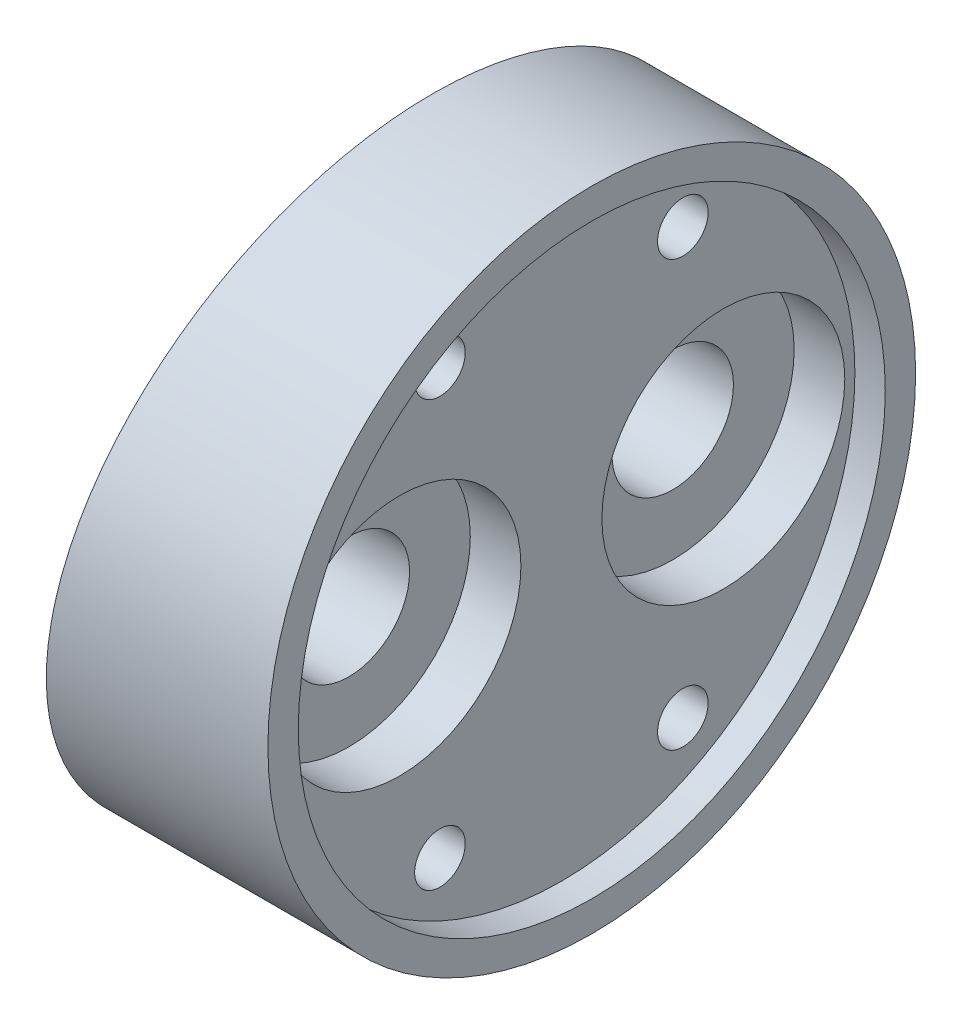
ISO-10303-21;
HEADER;
FILE_DESCRIPTION(('STEP AP214'),'2;1');
FILE_NAME('part.step','',(''),(''),'','','');
FILE_SCHEMA(('AUTOMOTIVE_DESIGN { 1 0 10303 214 1 1 1 1 }'));
ENDSEC;
DATA;
#1=APPLICATION_CONTEXT('core data for automotive mechanical design processes');
#2=APPLICATION_PROTOCOL_DEFINITION('international standard','automotive_design',2000,#1);
#3=PRODUCT_CONTEXT('',#1,'mechanical');
#4=PRODUCT('Part','Part','',(#3));
#5=PRODUCT_RELATED_PRODUCT_CATEGORY('part','',(#4));
#6=PRODUCT_DEFINITION_FORMATION('','',#4);
#7=PRODUCT_DEFINITION_CONTEXT('part definition',#1,'design');
#8=PRODUCT_DEFINITION('design','',#6,#7);
#9=PRODUCT_DEFINITION_SHAPE('','',#8);
#10=(LENGTH_UNIT() NAMED_UNIT(*) SI_UNIT(.MILLI.,.METRE.));
#11=(NAMED_UNIT(*) PLANE_ANGLE_UNIT() SI_UNIT($,.RADIAN.));
#12=(NAMED_UNIT(*) SI_UNIT($,.STERADIAN.) SOLID_ANGLE_UNIT());
#13=UNCERTAINTY_MEASURE_WITH_UNIT(LENGTH_MEASURE(1.E-05),#10,'distance_accuracy_value','');
#14=(GEOMETRIC_REPRESENTATION_CONTEXT(3) GLOBAL_UNCERTAINTY_ASSIGNED_CONTEXT((#13)) GLOBAL_UNIT_ASSIGNED_CONTEXT((#10,
#11,#12)) REPRESENTATION_CONTEXT('',''));
#15=CARTESIAN_POINT('',(0.,0.,0.));
#16=DIRECTION('',(0.,0.,1.));
#17=DIRECTION('',(1.,0.,0.));
#18=AXIS2_PLACEMENT_3D('',#15,#16,#17);
#19=CARTESIAN_POINT('',(10.7,0.,-8.));
#20=DIRECTION('',(1.,0.,0.));
#21=DIRECTION('',(0.,0.,-1.));
#22=AXIS2_PLACEMENT_3D('',#19,#20,#21);
#23=CYLINDRICAL_SURFACE('',#22,3.);
#24=CARTESIAN_POINT('',(1.9,0.,-8.));
#25=DIRECTION('',(1.,0.,0.));
#26=DIRECTION('',(0.,0.,-1.));
#27=AXIS2_PLACEMENT_3D('',#24,#25,#26);
#28=CIRCLE('',#27,3.);
#29=CARTESIAN_POINT('',(1.9,0.,-11.));
#30=VERTEX_POINT('',#29);
#31=EDGE_CURVE('E106',#30,#30,#28,.T.);
#32=ORIENTED_EDGE('',*,*,#31,.F.);
#33=EDGE_LOOP('',(#32));
#34=FACE_BOUND('',#33,.T.);
#35=CARTESIAN_POINT('',(6.7,0.,-8.));
#36=DIRECTION('',(1.,0.,0.));
#37=DIRECTION('',(0.,0.,-1.));
#38=AXIS2_PLACEMENT_3D('',#35,#36,#37);
#39=CIRCLE('',#38,3.);
#40=CARTESIAN_POINT('',(6.7,0.,-11.));
#41=VERTEX_POINT('',#40);
#42=EDGE_CURVE('E38',#41,#41,#39,.F.);
#43=ORIENTED_EDGE('',*,*,#42,.F.);
#44=EDGE_LOOP('',(#43));
#45=FACE_BOUND('',#44,.T.);
#46=ADVANCED_FACE('F34',(#34,#45),#23,.F.);
#47=CARTESIAN_POINT('',(10.7,0.,8.));
#48=DIRECTION('',(1.,0.,0.));
#49=DIRECTION('',(0.,0.,-1.));
#50=AXIS2_PLACEMENT_3D('',#47,#48,#49);
#51=CYLINDRICAL_SURFACE('',#50,3.);
#52=CARTESIAN_POINT('',(1.9,0.,8.));
#53=DIRECTION('',(1.,0.,0.));
#54=DIRECTION('',(0.,0.,-1.));
#55=AXIS2_PLACEMENT_3D('',#52,#53,#54);
#56=CIRCLE('',#55,3.);
#57=CARTESIAN_POINT('',(1.9,0.,5.));
#58=VERTEX_POINT('',#57);
#59=EDGE_CURVE('E109',#58,#58,#56,.T.);
#60=ORIENTED_EDGE('',*,*,#59,.F.);
#61=EDGE_LOOP('',(#60));
#62=FACE_BOUND('',#61,.T.);
#63=CARTESIAN_POINT('',(6.7,0.,8.));
#64=DIRECTION('',(1.,0.,0.));
#65=DIRECTION('',(0.,0.,-1.));
#66=AXIS2_PLACEMENT_3D('',#63,#64,#65);
#67=CIRCLE('',#66,3.);
#68=CARTESIAN_POINT('',(6.7,0.,5.));
#69=VERTEX_POINT('',#68);
#70=EDGE_CURVE('E74',#69,#69,#67,.F.);
#71=ORIENTED_EDGE('',*,*,#70,.F.);
#72=EDGE_LOOP('',(#71));
#73=FACE_BOUND('',#72,.T.);
#74=ADVANCED_FACE('F153',(#62,#73),#51,.F.);
#75=CARTESIAN_POINT('',(10.7,0.,0.));
#76=DIRECTION('',(-1.,0.,0.));
#77=DIRECTION('',(0.,0.,1.));
#78=AXIS2_PLACEMENT_3D('',#75,#76,#77);
#79=PLANE('',#78);
#80=CARTESIAN_POINT('',(10.7,0.,0.));
#81=DIRECTION('',(1.,0.,0.));
#82=DIRECTION('',(0.,0.,-1.));
#83=AXIS2_PLACEMENT_3D('',#80,#81,#82);
#84=CIRCLE('',#83,14.5);
#85=CARTESIAN_POINT('',(10.7,0.,-14.5));
#86=VERTEX_POINT('',#85);
#87=EDGE_CURVE('E92',#86,#86,#84,.T.);
#88=ORIENTED_EDGE('',*,*,#87,.F.);
#89=EDGE_LOOP('',(#88));
#90=FACE_BOUND('',#89,.T.);
#91=CARTESIAN_POINT('',(10.7000000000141,0.,0.));
#92=DIRECTION('',(-1.,0.,0.));
#93=DIRECTION('',(0.,0.,1.));
#94=AXIS2_PLACEMENT_3D('',#91,#92,#93);
#95=CIRCLE('',#94,16.);
#96=CARTESIAN_POINT('',(10.7000000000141,0.,16.));
#97=VERTEX_POINT('',#96);
#98=EDGE_CURVE('E43',#97,#97,#95,.T.);
#99=ORIENTED_EDGE('',*,*,#98,.F.);
#100=EDGE_LOOP('',(#99));
#101=FACE_BOUND('',#100,.T.);
#102=ADVANCED_FACE('F36',(#90,#101),#79,.F.);
#103=CARTESIAN_POINT('',(-200068.176472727,0.,0.));
#104=DIRECTION('',(-1.,0.,0.));
#105=DIRECTION('',(0.,0.,1.));
#106=AXIS2_PLACEMENT_3D('',#103,#104,#105);
#107=CYLINDRICAL_SURFACE('',#106,16.);
#108=CARTESIAN_POINT('',(0.,0.,0.));
#109=DIRECTION('',(0.984807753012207,-0.173648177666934,0.));
#110=DIRECTION('',(-0.173648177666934,-0.984807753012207,0.));
#111=AXIS2_PLACEMENT_3D('',#108,#109,#110);
#112=ELLIPSE('',#111,16.2468257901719,16.);
#113=CARTESIAN_POINT('',(-2.8212316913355,-16.,0.));
#114=VERTEX_POINT('',#113);
#115=EDGE_CURVE('E11',#114,#114,#112,.T.);
#116=ORIENTED_EDGE('',*,*,#115,.T.);
#117=EDGE_LOOP('',(#116));
#118=FACE_BOUND('',#117,.T.);
#119=ORIENTED_EDGE('',*,*,#98,.T.);
#120=EDGE_LOOP('',(#119));
#121=FACE_BOUND('',#120,.T.);
#122=ADVANCED_FACE('F177',(#118,#121),#107,.T.);
#123=CARTESIAN_POINT('',(-2.8212316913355,-16.,-50.));
#124=DIRECTION('',(0.984807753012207,-0.173648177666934,0.));
#125=DIRECTION('',(0.173648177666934,0.984807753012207,0.));
#126=AXIS2_PLACEMENT_3D('',#123,#124,#125);
#127=PLANE('',#126);
#128=CARTESIAN_POINT('',(0.,0.,-8.));
#129=DIRECTION('',(0.984807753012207,-0.173648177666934,0.));
#130=DIRECTION('',(0.173648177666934,0.984807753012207,0.));
#131=AXIS2_PLACEMENT_3D('',#128,#129,#130);
#132=ELLIPSE('',#131,0.0761569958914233,0.0749999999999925);
#133=CARTESIAN_POINT('',(0.0132245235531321,0.0749999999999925,-8.));
#134=VERTEX_POINT('',#133);
#135=EDGE_CURVE('E96',#134,#134,#132,.T.);
#136=ORIENTED_EDGE('',*,*,#135,.T.);
#137=EDGE_LOOP('',(#136));
#138=FACE_BOUND('',#137,.T.);
#139=CARTESIAN_POINT('',(0.,0.,8.));
#140=DIRECTION('',(0.984807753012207,-0.173648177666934,0.));
#141=DIRECTION('',(0.173648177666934,0.984807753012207,0.));
#142=AXIS2_PLACEMENT_3D('',#139,#140,#141);
#143=ELLIPSE('',#142,0.0761569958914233,0.0749999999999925);
#144=CARTESIAN_POINT('',(0.0132245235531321,0.0749999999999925,8.));
#145=VERTEX_POINT('',#144);
#146=EDGE_CURVE('E103',#145,#145,#143,.T.);
#147=ORIENTED_EDGE('',*,*,#146,.T.);
#148=EDGE_LOOP('',(#147));
#149=FACE_BOUND('',#148,.T.);
#150=ORIENTED_EDGE('',*,*,#115,.F.);
#151=EDGE_LOOP('',(#150));
#152=FACE_BOUND('',#151,.T.);
#153=ADVANCED_FACE('F174',(#138,#149,#152),#127,.F.);
#154=CARTESIAN_POINT('',(1.9,0.,8.));
#155=DIRECTION('',(1.,0.,0.));
#156=DIRECTION('',(0.,0.,-1.));
#157=AXIS2_PLACEMENT_3D('',#154,#155,#156);
#158=CONICAL_SURFACE('',#157,3.,1.0471975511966);
#159=CARTESIAN_POINT('',(0.211250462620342,0.,8.));
#160=DIRECTION('',(1.,0.,0.));
#161=DIRECTION('',(0.,0.,-1.));
#162=AXIS2_PLACEMENT_3D('',#159,#160,#161);
#163=CIRCLE('',#162,0.0749999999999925);
#164=CARTESIAN_POINT('',(0.211250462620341,0.,7.92500000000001));
#165=VERTEX_POINT('',#164);
#166=EDGE_CURVE('E102',#165,#165,#163,.F.);
#167=CARTESIAN_POINT('',(0.211250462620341,0.,7.92500000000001));
#168=CARTESIAN_POINT('',(0.228841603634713,0.,7.89453125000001));
#169=CARTESIAN_POINT('',(0.246432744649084,0.,7.86406250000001));
#170=CARTESIAN_POINT('',(0.281615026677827,0.,7.80312500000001));
#171=CARTESIAN_POINT('',(0.299206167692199,0.,7.77265625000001));
#172=CARTESIAN_POINT('',(0.334388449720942,0.,7.71171875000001));
#173=CARTESIAN_POINT('',(0.351979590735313,0.,7.68125000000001));
#174=CARTESIAN_POINT('',(0.387161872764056,0.,7.62031250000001));
#175=CARTESIAN_POINT('',(0.404753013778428,0.,7.58984375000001));
#176=CARTESIAN_POINT('',(0.439935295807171,0.,7.52890625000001));
#177=CARTESIAN_POINT('',(0.457526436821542,0.,7.49843750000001));
#178=CARTESIAN_POINT('',(0.492708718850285,0.,7.43750000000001));
#179=CARTESIAN_POINT('',(0.510299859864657,0.,7.40703125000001));
#180=CARTESIAN_POINT('',(0.5454821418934,0.,7.34609375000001));
#181=CARTESIAN_POINT('',(0.563073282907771,0.,7.31562500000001));
#182=CARTESIAN_POINT('',(0.598255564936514,0.,7.25468750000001));
#183=CARTESIAN_POINT('',(0.615846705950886,0.,7.22421875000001));
#184=CARTESIAN_POINT('',(0.651028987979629,0.,7.16328125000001));
#185=CARTESIAN_POINT('',(0.668620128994,0.,7.13281250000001));
#186=CARTESIAN_POINT('',(0.703802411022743,0.,7.07187500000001));
#187=CARTESIAN_POINT('',(0.721393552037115,0.,7.04140625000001));
#188=CARTESIAN_POINT('',(0.756575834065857,0.,6.98046875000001));
#189=CARTESIAN_POINT('',(0.774166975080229,0.,6.95000000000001));
#190=CARTESIAN_POINT('',(0.809349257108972,0.,6.88906250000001));
#191=CARTESIAN_POINT('',(0.826940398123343,0.,6.85859375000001));
#192=CARTESIAN_POINT('',(0.862122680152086,0.,6.79765625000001));
#193=CARTESIAN_POINT('',(0.879713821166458,0.,6.76718750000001));
#194=CARTESIAN_POINT('',(0.914896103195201,0.,6.70625000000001));
#195=CARTESIAN_POINT('',(0.932487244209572,0.,6.67578125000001));
#196=CARTESIAN_POINT('',(0.967669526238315,0.,6.61484375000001));
#197=CARTESIAN_POINT('',(0.985260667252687,0.,6.584375));
#198=CARTESIAN_POINT('',(1.02044294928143,0.,6.52343750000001));
#199=CARTESIAN_POINT('',(1.0380340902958,0.,6.49296875));
#200=CARTESIAN_POINT('',(1.07321637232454,0.,6.43203125));
#201=CARTESIAN_POINT('',(1.09080751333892,0.,6.40156250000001));
#202=CARTESIAN_POINT('',(1.12598979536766,0.,6.34062500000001));
#203=CARTESIAN_POINT('',(1.14358093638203,0.,6.31015625));
#204=CARTESIAN_POINT('',(1.17876321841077,0.,6.24921875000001));
#205=CARTESIAN_POINT('',(1.19635435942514,0.,6.21875));
#206=CARTESIAN_POINT('',(1.23153664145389,0.,6.1578125));
#207=CARTESIAN_POINT('',(1.24912778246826,0.,6.12734375));
#208=CARTESIAN_POINT('',(1.284310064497,0.,6.06640625));
#209=CARTESIAN_POINT('',(1.30190120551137,0.,6.0359375));
#210=CARTESIAN_POINT('',(1.33708348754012,0.,5.975));
#211=CARTESIAN_POINT('',(1.35467462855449,0.,5.94453125));
#212=CARTESIAN_POINT('',(1.38985691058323,0.,5.88359375));
#213=CARTESIAN_POINT('',(1.4074480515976,0.,5.853125));
#214=CARTESIAN_POINT('',(1.44263033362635,0.,5.7921875));
#215=CARTESIAN_POINT('',(1.46022147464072,0.,5.76171875));
#216=CARTESIAN_POINT('',(1.49540375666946,0.,5.70078125));
#217=CARTESIAN_POINT('',(1.51299489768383,0.,5.6703125));
#218=CARTESIAN_POINT('',(1.54817717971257,0.,5.609375));
#219=CARTESIAN_POINT('',(1.56576832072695,0.,5.57890625));
#220=CARTESIAN_POINT('',(1.60095060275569,0.,5.51796875));
#221=CARTESIAN_POINT('',(1.61854174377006,0.,5.4875));
#222=CARTESIAN_POINT('',(1.6537240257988,0.,5.4265625));
#223=CARTESIAN_POINT('',(1.67131516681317,0.,5.39609375));
#224=CARTESIAN_POINT('',(1.70649744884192,0.,5.33515625));
#225=CARTESIAN_POINT('',(1.72408858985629,0.,5.3046875));
#226=CARTESIAN_POINT('',(1.75927087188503,0.,5.24375));
#227=CARTESIAN_POINT('',(1.7768620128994,0.,5.21328125));
#228=CARTESIAN_POINT('',(1.81204429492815,0.,5.15234375));
#229=CARTESIAN_POINT('',(1.82963543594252,0.,5.121875));
#230=CARTESIAN_POINT('',(1.86481771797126,0.,5.0609375));
#231=CARTESIAN_POINT('',(1.88240885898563,0.,5.03046875));
#232=CARTESIAN_POINT('',(1.9,0.,5.));
#233=B_SPLINE_CURVE_WITH_KNOTS('',3,(#167,#168,#169,#170,#171,#172,#173,#174,#175,#176,#177,
#178,#179,#180,#181,#182,#183,#184,#185,#186,#187,#188,#189,#190,#191,#192,#193,#194,#195,#196,
#197,#198,#199,#200,#201,#202,#203,#204,#205,#206,#207,#208,#209,#210,#211,#212,#213,#214,#215,
#216,#217,#218,#219,#220,#221,#222,#223,#224,#225,#226,#227,#228,#229,#230,#231,#232),
.UNSPECIFIED.,.F.,.F.,(4,2,2,2,2,2,2,2,2,2,2,2,2,2,2,2,2,2,2,2,2,2,2,2,2,2,2,2,2,2,2,2,4),(0.,
0.105546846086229,0.211093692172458,0.316640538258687,0.422187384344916,0.527734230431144,
0.633281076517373,0.738827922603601,0.84437476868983,0.949921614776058,1.05546846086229,
1.16101530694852,1.26656215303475,1.37210899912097,1.4776558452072,1.58320269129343,
1.68874953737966,1.79429638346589,1.89984322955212,2.00539007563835,2.11093692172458,
2.2164837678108,2.32203061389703,2.42757745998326,2.53312430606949,2.63867115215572,
2.74421799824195,2.84976484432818,2.95531169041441,3.06085853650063,3.16640538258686,
3.27195222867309,3.37749907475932),.UNSPECIFIED.);
#234=EDGE_CURVE('BSEAM169',#165,#58,#233,.T.);
#235=ORIENTED_EDGE('',*,*,#166,.T.);
#236=ORIENTED_EDGE('',*,*,#59,.T.);
#237=ORIENTED_EDGE('',*,*,#234,.T.);
#238=ORIENTED_EDGE('',*,*,#234,.F.);
#239=EDGE_LOOP('',(#235,#237,#236,#238));
#240=FACE_BOUND('',#239,.T.);
#241=ADVANCED_FACE('F169',(#240),#158,.F.);
#242=CARTESIAN_POINT('',(1.9,0.,-8.));
#243=DIRECTION('',(1.,0.,0.));
#244=DIRECTION('',(0.,0.,-1.));
#245=AXIS2_PLACEMENT_3D('',#242,#243,#244);
#246=CONICAL_SURFACE('',#245,3.,1.0471975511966);
#247=CARTESIAN_POINT('',(0.211250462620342,0.,-8.));
#248=DIRECTION('',(1.,0.,0.));
#249=DIRECTION('',(0.,0.,-1.));
#250=AXIS2_PLACEMENT_3D('',#247,#248,#249);
#251=CIRCLE('',#250,0.0749999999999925);
#252=CARTESIAN_POINT('',(0.211250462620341,0.,-8.07499999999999));
#253=VERTEX_POINT('',#252);
#254=EDGE_CURVE('E99',#253,#253,#251,.F.);
#255=CARTESIAN_POINT('',(0.211250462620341,0.,-8.07499999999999));
#256=CARTESIAN_POINT('',(0.228841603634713,0.,-8.10546874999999));
#257=CARTESIAN_POINT('',(0.246432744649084,0.,-8.13593749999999));
#258=CARTESIAN_POINT('',(0.281615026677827,0.,-8.19687499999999));
#259=CARTESIAN_POINT('',(0.299206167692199,0.,-8.22734374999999));
#260=CARTESIAN_POINT('',(0.334388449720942,0.,-8.28828124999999));
#261=CARTESIAN_POINT('',(0.351979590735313,0.,-8.31874999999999));
#262=CARTESIAN_POINT('',(0.387161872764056,0.,-8.37968749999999));
#263=CARTESIAN_POINT('',(0.404753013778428,0.,-8.41015624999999));
#264=CARTESIAN_POINT('',(0.439935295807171,0.,-8.47109374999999));
#265=CARTESIAN_POINT('',(0.457526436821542,0.,-8.50156249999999));
#266=CARTESIAN_POINT('',(0.492708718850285,0.,-8.56249999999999));
#267=CARTESIAN_POINT('',(0.510299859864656,0.,-8.59296874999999));
#268=CARTESIAN_POINT('',(0.5454821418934,0.,-8.65390624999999));
#269=CARTESIAN_POINT('',(0.563073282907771,0.,-8.68437499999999));
#270=CARTESIAN_POINT('',(0.598255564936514,0.,-8.74531249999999));
#271=CARTESIAN_POINT('',(0.615846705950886,0.,-8.77578124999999));
#272=CARTESIAN_POINT('',(0.651028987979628,0.,-8.83671874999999));
#273=CARTESIAN_POINT('',(0.668620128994,0.,-8.86718749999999));
#274=CARTESIAN_POINT('',(0.703802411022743,0.,-8.92812499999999));
#275=CARTESIAN_POINT('',(0.721393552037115,0.,-8.95859374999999));
#276=CARTESIAN_POINT('',(0.756575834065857,0.,-9.01953124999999));
#277=CARTESIAN_POINT('',(0.774166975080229,0.,-9.04999999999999));
#278=CARTESIAN_POINT('',(0.809349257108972,0.,-9.11093749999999));
#279=CARTESIAN_POINT('',(0.826940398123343,0.,-9.14140624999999));
#280=CARTESIAN_POINT('',(0.862122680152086,0.,-9.20234374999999));
#281=CARTESIAN_POINT('',(0.879713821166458,0.,-9.23281249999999));
#282=CARTESIAN_POINT('',(0.914896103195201,0.,-9.29374999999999));
#283=CARTESIAN_POINT('',(0.932487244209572,0.,-9.32421874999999));
#284=CARTESIAN_POINT('',(0.967669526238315,0.,-9.38515624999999));
#285=CARTESIAN_POINT('',(0.985260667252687,0.,-9.415625));
#286=CARTESIAN_POINT('',(1.02044294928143,0.,-9.47656249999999));
#287=CARTESIAN_POINT('',(1.0380340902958,0.,-9.50703125));
#288=CARTESIAN_POINT('',(1.07321637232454,0.,-9.56796875));
#289=CARTESIAN_POINT('',(1.09080751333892,0.,-9.5984375));
#290=CARTESIAN_POINT('',(1.12598979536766,0.,-9.659375));
#291=CARTESIAN_POINT('',(1.14358093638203,0.,-9.68984375));
#292=CARTESIAN_POINT('',(1.17876321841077,0.,-9.75078125));
#293=CARTESIAN_POINT('',(1.19635435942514,0.,-9.78124999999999));
#294=CARTESIAN_POINT('',(1.23153664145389,0.,-9.84218749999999));
#295=CARTESIAN_POINT('',(1.24912778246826,0.,-9.87265625));
#296=CARTESIAN_POINT('',(1.284310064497,0.,-9.93359374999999));
#297=CARTESIAN_POINT('',(1.30190120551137,0.,-9.9640625));
#298=CARTESIAN_POINT('',(1.33708348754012,0.,-10.025));
#299=CARTESIAN_POINT('',(1.35467462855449,0.,-10.05546875));
#300=CARTESIAN_POINT('',(1.38985691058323,0.,-10.11640625));
#301=CARTESIAN_POINT('',(1.4074480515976,0.,-10.146875));
#302=CARTESIAN_POINT('',(1.44263033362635,0.,-10.2078125));
#303=CARTESIAN_POINT('',(1.46022147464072,0.,-10.23828125));
#304=CARTESIAN_POINT('',(1.49540375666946,0.,-10.29921875));
#305=CARTESIAN_POINT('',(1.51299489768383,0.,-10.3296875));
#306=CARTESIAN_POINT('',(1.54817717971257,0.,-10.390625));
#307=CARTESIAN_POINT('',(1.56576832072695,0.,-10.42109375));
#308=CARTESIAN_POINT('',(1.60095060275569,0.,-10.48203125));
#309=CARTESIAN_POINT('',(1.61854174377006,0.,-10.5125));
#310=CARTESIAN_POINT('',(1.6537240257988,0.,-10.5734375));
#311=CARTESIAN_POINT('',(1.67131516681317,0.,-10.60390625));
#312=CARTESIAN_POINT('',(1.70649744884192,0.,-10.66484375));
#313=CARTESIAN_POINT('',(1.72408858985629,0.,-10.6953125));
#314=CARTESIAN_POINT('',(1.75927087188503,0.,-10.75625));
#315=CARTESIAN_POINT('',(1.7768620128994,0.,-10.78671875));
#316=CARTESIAN_POINT('',(1.81204429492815,0.,-10.84765625));
#317=CARTESIAN_POINT('',(1.82963543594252,0.,-10.878125));
#318=CARTESIAN_POINT('',(1.86481771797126,0.,-10.9390625));
#319=CARTESIAN_POINT('',(1.88240885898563,0.,-10.96953125));
#320=CARTESIAN_POINT('',(1.9,0.,-11.));
#321=B_SPLINE_CURVE_WITH_KNOTS('',3,(#255,#256,#257,#258,#259,#260,#261,#262,#263,#264,#265,
#266,#267,#268,#269,#270,#271,#272,#273,#274,#275,#276,#277,#278,#279,#280,#281,#282,#283,#284,
#285,#286,#287,#288,#289,#290,#291,#292,#293,#294,#295,#296,#297,#298,#299,#300,#301,#302,#303,
#304,#305,#306,#307,#308,#309,#310,#311,#312,#313,#314,#315,#316,#317,#318,#319,#320),
.UNSPECIFIED.,.F.,.F.,(4,2,2,2,2,2,2,2,2,2,2,2,2,2,2,2,2,2,2,2,2,2,2,2,2,2,2,2,2,2,2,2,4),(0.,
0.105546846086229,0.211093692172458,0.316640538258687,0.422187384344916,0.527734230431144,
0.633281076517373,0.738827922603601,0.844374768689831,0.949921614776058,1.05546846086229,
1.16101530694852,1.26656215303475,1.37210899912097,1.4776558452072,1.58320269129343,
1.68874953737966,1.79429638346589,1.89984322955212,2.00539007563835,2.11093692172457,
2.2164837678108,2.32203061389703,2.42757745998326,2.53312430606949,2.63867115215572,
2.74421799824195,2.84976484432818,2.95531169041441,3.06085853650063,3.16640538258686,
3.27195222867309,3.37749907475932),.UNSPECIFIED.);
#322=EDGE_CURVE('BSEAM167',#253,#30,#321,.T.);
#323=ORIENTED_EDGE('',*,*,#254,.T.);
#324=ORIENTED_EDGE('',*,*,#31,.T.);
#325=ORIENTED_EDGE('',*,*,#322,.T.);
#326=ORIENTED_EDGE('',*,*,#322,.F.);
#327=EDGE_LOOP('',(#323,#325,#324,#326));
#328=FACE_BOUND('',#327,.T.);
#329=ADVANCED_FACE('F167',(#328),#246,.F.);
#330=CARTESIAN_POINT('',(10.7,0.,8.));
#331=DIRECTION('',(1.,0.,0.));
#332=DIRECTION('',(0.,0.,-1.));
#333=AXIS2_PLACEMENT_3D('',#330,#331,#332);
#334=CYLINDRICAL_SURFACE('',#333,0.0749999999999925);
#335=ORIENTED_EDGE('',*,*,#166,.F.);
#336=EDGE_LOOP('',(#335));
#337=FACE_BOUND('',#336,.T.);
#338=ORIENTED_EDGE('',*,*,#146,.F.);
#339=EDGE_LOOP('',(#338));
#340=FACE_BOUND('',#339,.T.);
#341=ADVANCED_FACE('F165',(#337,#340),#334,.F.);
#342=CARTESIAN_POINT('',(10.7,0.,-8.));
#343=DIRECTION('',(1.,0.,0.));
#344=DIRECTION('',(0.,0.,-1.));
#345=AXIS2_PLACEMENT_3D('',#342,#343,#344);
#346=CYLINDRICAL_SURFACE('',#345,0.0749999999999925);
#347=ORIENTED_EDGE('',*,*,#135,.F.);
#348=EDGE_LOOP('',(#347));
#349=FACE_BOUND('',#348,.T.);
#350=ORIENTED_EDGE('',*,*,#254,.F.);
#351=EDGE_LOOP('',(#350));
#352=FACE_BOUND('',#351,.T.);
#353=ADVANCED_FACE('F206',(#349,#352),#346,.F.);
#354=CARTESIAN_POINT('',(9.2,0.,0.));
#355=DIRECTION('',(1.,0.,0.));
#356=DIRECTION('',(0.,0.,-1.));
#357=AXIS2_PLACEMENT_3D('',#354,#355,#356);
#358=PLANE('',#357);
#359=CARTESIAN_POINT('',(9.2,0.,-8.));
#360=DIRECTION('',(1.,0.,0.));
#361=DIRECTION('',(0.,0.,-1.));
#362=AXIS2_PLACEMENT_3D('',#359,#360,#361);
#363=CIRCLE('',#362,6.);
#364=CARTESIAN_POINT('',(9.2,0.,-14.));
#365=VERTEX_POINT('',#364);
#366=EDGE_CURVE('E123',#365,#365,#363,.T.);
#367=ORIENTED_EDGE('',*,*,#366,.F.);
#368=EDGE_LOOP('',(#367));
#369=FACE_BOUND('',#368,.T.);
#370=CARTESIAN_POINT('',(9.2,0.,8.));
#371=DIRECTION('',(1.,0.,0.));
#372=DIRECTION('',(0.,0.,-1.));
#373=AXIS2_PLACEMENT_3D('',#370,#371,#372);
#374=CIRCLE('',#373,6.);
#375=CARTESIAN_POINT('',(9.2,0.,2.));
#376=VERTEX_POINT('',#375);
#377=EDGE_CURVE('E118',#376,#376,#374,.T.);
#378=ORIENTED_EDGE('',*,*,#377,.F.);
#379=EDGE_LOOP('',(#378));
#380=FACE_BOUND('',#379,.T.);
#381=CARTESIAN_POINT('',(9.2,10.5,-6.));
#382=DIRECTION('',(1.,0.,0.));
#383=DIRECTION('',(0.,0.,-1.));
#384=AXIS2_PLACEMENT_3D('',#381,#382,#383);
#385=CIRCLE('',#384,1.25);
#386=CARTESIAN_POINT('',(9.2,10.5,-7.25));
#387=VERTEX_POINT('',#386);
#388=EDGE_CURVE('E68',#387,#387,#385,.T.);
#389=ORIENTED_EDGE('',*,*,#388,.F.);
#390=EDGE_LOOP('',(#389));
#391=FACE_BOUND('',#390,.T.);
#392=CARTESIAN_POINT('',(9.2,10.5,6.));
#393=DIRECTION('',(1.,0.,0.));
#394=DIRECTION('',(0.,0.,-1.));
#395=AXIS2_PLACEMENT_3D('',#392,#393,#394);
#396=CIRCLE('',#395,1.25);
#397=CARTESIAN_POINT('',(9.2,10.5,4.75));
#398=VERTEX_POINT('',#397);
#399=EDGE_CURVE('E67',#398,#398,#396,.T.);
#400=ORIENTED_EDGE('',*,*,#399,.F.);
#401=EDGE_LOOP('',(#400));
#402=FACE_BOUND('',#401,.T.);
#403=CARTESIAN_POINT('',(9.2,-10.5,6.));
#404=DIRECTION('',(1.,0.,0.));
#405=DIRECTION('',(0.,0.,-1.));
#406=AXIS2_PLACEMENT_3D('',#403,#404,#405);
#407=CIRCLE('',#406,1.25);
#408=CARTESIAN_POINT('',(9.2,-10.5,4.75));
#409=VERTEX_POINT('',#408);
#410=EDGE_CURVE('E80',#409,#409,#407,.T.);
#411=ORIENTED_EDGE('',*,*,#410,.F.);
#412=EDGE_LOOP('',(#411));
#413=FACE_BOUND('',#412,.T.);
#414=CARTESIAN_POINT('',(9.2,-10.5,-6.));
#415=DIRECTION('',(1.,0.,0.));
#416=DIRECTION('',(0.,0.,-1.));
#417=AXIS2_PLACEMENT_3D('',#414,#415,#416);
#418=CIRCLE('',#417,1.25);
#419=CARTESIAN_POINT('',(9.2,-10.5,-7.25));
#420=VERTEX_POINT('',#419);
#421=EDGE_CURVE('E86',#420,#420,#418,.T.);
#422=ORIENTED_EDGE('',*,*,#421,.F.);
#423=EDGE_LOOP('',(#422));
#424=FACE_BOUND('',#423,.T.);
#425=CARTESIAN_POINT('',(9.2,0.,0.));
#426=DIRECTION('',(1.,0.,0.));
#427=DIRECTION('',(0.,0.,-1.));
#428=AXIS2_PLACEMENT_3D('',#425,#426,#427);
#429=CIRCLE('',#428,14.5);
#430=CARTESIAN_POINT('',(9.2,0.,-14.5));
#431=VERTEX_POINT('',#430);
#432=EDGE_CURVE('E93',#431,#431,#429,.T.);
#433=ORIENTED_EDGE('',*,*,#432,.T.);
#434=EDGE_LOOP('',(#433));
#435=FACE_BOUND('',#434,.T.);
#436=ADVANCED_FACE('F197',(#369,#380,#391,#402,#413,#424,#435),#358,.T.);
#437=CARTESIAN_POINT('',(9.2,0.,0.));
#438=DIRECTION('',(1.,0.,0.));
#439=DIRECTION('',(0.,0.,-1.));
#440=AXIS2_PLACEMENT_3D('',#437,#438,#439);
#441=CYLINDRICAL_SURFACE('',#440,14.5);
#442=ORIENTED_EDGE('',*,*,#432,.F.);
#443=EDGE_LOOP('',(#442));
#444=FACE_BOUND('',#443,.T.);
#445=ORIENTED_EDGE('',*,*,#87,.T.);
#446=EDGE_LOOP('',(#445));
#447=FACE_BOUND('',#446,.T.);
#448=ADVANCED_FACE('F194',(#444,#447),#441,.F.);
#449=CARTESIAN_POINT('',(3.20000000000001,-10.5,-6.));
#450=DIRECTION('',(1.,0.,0.));
#451=DIRECTION('',(0.,0.,-1.));
#452=AXIS2_PLACEMENT_3D('',#449,#450,#451);
#453=CONICAL_SURFACE('',#452,1.25,1.02974425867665);
#454=CARTESIAN_POINT('',(2.44892422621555,-10.5,-6.));
#455=VERTEX_POINT('',#454);
#456=VERTEX_LOOP('',#455);
#457=FACE_BOUND('',#456,.T.);
#458=CARTESIAN_POINT('',(3.20000000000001,-10.5,-6.));
#459=DIRECTION('',(1.,0.,0.));
#460=DIRECTION('',(0.,0.,-1.));
#461=AXIS2_PLACEMENT_3D('',#458,#459,#460);
#462=CIRCLE('',#461,1.25);
#463=CARTESIAN_POINT('',(3.20000000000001,-10.5,-7.25));
#464=VERTEX_POINT('',#463);
#465=EDGE_CURVE('E89',#464,#464,#462,.T.);
#466=ORIENTED_EDGE('',*,*,#465,.T.);
#467=EDGE_LOOP('',(#466));
#468=FACE_BOUND('',#467,.T.);
#469=ADVANCED_FACE('F196',(#457,#468),#453,.F.);
#470=CARTESIAN_POINT('',(9.2,-10.5,-6.));
#471=DIRECTION('',(1.,0.,0.));
#472=DIRECTION('',(0.,0.,-1.));
#473=AXIS2_PLACEMENT_3D('',#470,#471,#472);
#474=CYLINDRICAL_SURFACE('',#473,1.25);
#475=ORIENTED_EDGE('',*,*,#465,.F.);
#476=EDGE_LOOP('',(#475));
#477=FACE_BOUND('',#476,.T.);
#478=ORIENTED_EDGE('',*,*,#421,.T.);
#479=EDGE_LOOP('',(#478));
#480=FACE_BOUND('',#479,.T.);
#481=ADVANCED_FACE('F204',(#477,#480),#474,.F.);
#482=CARTESIAN_POINT('',(3.20000000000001,-10.5,6.));
#483=DIRECTION('',(1.,0.,0.));
#484=DIRECTION('',(0.,0.,-1.));
#485=AXIS2_PLACEMENT_3D('',#482,#483,#484);
#486=CONICAL_SURFACE('',#485,1.25,1.02974425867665);
#487=CARTESIAN_POINT('',(2.44892422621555,-10.5,6.));
#488=VERTEX_POINT('',#487);
#489=VERTEX_LOOP('',#488);
#490=FACE_BOUND('',#489,.T.);
#491=CARTESIAN_POINT('',(3.20000000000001,-10.5,6.));
#492=DIRECTION('',(1.,0.,0.));
#493=DIRECTION('',(0.,0.,-1.));
#494=AXIS2_PLACEMENT_3D('',#491,#492,#493);
#495=CIRCLE('',#494,1.25);
#496=CARTESIAN_POINT('',(3.20000000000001,-10.5,4.75));
#497=VERTEX_POINT('',#496);
#498=EDGE_CURVE('E83',#497,#497,#495,.T.);
#499=ORIENTED_EDGE('',*,*,#498,.T.);
#500=EDGE_LOOP('',(#499));
#501=FACE_BOUND('',#500,.T.);
#502=ADVANCED_FACE('F273',(#490,#501),#486,.F.);
#503=CARTESIAN_POINT('',(9.2,-10.5,6.));
#504=DIRECTION('',(1.,0.,0.));
#505=DIRECTION('',(0.,0.,-1.));
#506=AXIS2_PLACEMENT_3D('',#503,#504,#505);
#507=CYLINDRICAL_SURFACE('',#506,1.25);
#508=ORIENTED_EDGE('',*,*,#498,.F.);
#509=EDGE_LOOP('',(#508));
#510=FACE_BOUND('',#509,.T.);
#511=ORIENTED_EDGE('',*,*,#410,.T.);
#512=EDGE_LOOP('',(#511));
#513=FACE_BOUND('',#512,.T.);
#514=ADVANCED_FACE('F284',(#510,#513),#507,.F.);
#515=CARTESIAN_POINT('',(3.20000000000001,10.5,6.));
#516=DIRECTION('',(1.,0.,0.));
#517=DIRECTION('',(0.,0.,-1.));
#518=AXIS2_PLACEMENT_3D('',#515,#516,#517);
#519=CONICAL_SURFACE('',#518,1.25,1.02974425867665);
#520=CARTESIAN_POINT('',(2.44892422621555,10.5,6.));
#521=VERTEX_POINT('',#520);
#522=VERTEX_LOOP('',#521);
#523=FACE_BOUND('',#522,.T.);
#524=CARTESIAN_POINT('',(3.20000000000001,10.5,6.));
#525=DIRECTION('',(1.,0.,0.));
#526=DIRECTION('',(0.,0.,-1.));
#527=AXIS2_PLACEMENT_3D('',#524,#525,#526);
#528=CIRCLE('',#527,1.25);
#529=CARTESIAN_POINT('',(3.20000000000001,10.5,4.75));
#530=VERTEX_POINT('',#529);
#531=EDGE_CURVE('E71',#530,#530,#528,.T.);
#532=ORIENTED_EDGE('',*,*,#531,.T.);
#533=EDGE_LOOP('',(#532));
#534=FACE_BOUND('',#533,.T.);
#535=ADVANCED_FACE('F293',(#523,#534),#519,.F.);
#536=CARTESIAN_POINT('',(9.2,10.5,6.));
#537=DIRECTION('',(1.,0.,0.));
#538=DIRECTION('',(0.,0.,-1.));
#539=AXIS2_PLACEMENT_3D('',#536,#537,#538);
#540=CYLINDRICAL_SURFACE('',#539,1.25);
#541=ORIENTED_EDGE('',*,*,#531,.F.);
#542=EDGE_LOOP('',(#541));
#543=FACE_BOUND('',#542,.T.);
#544=ORIENTED_EDGE('',*,*,#399,.T.);
#545=EDGE_LOOP('',(#544));
#546=FACE_BOUND('',#545,.T.);
#547=ADVANCED_FACE('F61',(#543,#546),#540,.F.);
#548=CARTESIAN_POINT('',(3.20000000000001,10.5,-6.));
#549=DIRECTION('',(1.,0.,0.));
#550=DIRECTION('',(0.,0.,-1.));
#551=AXIS2_PLACEMENT_3D('',#548,#549,#550);
#552=CONICAL_SURFACE('',#551,1.25,1.02974425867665);
#553=CARTESIAN_POINT('',(2.44892422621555,10.5,-6.));
#554=VERTEX_POINT('',#553);
#555=VERTEX_LOOP('',#554);
#556=FACE_BOUND('',#555,.T.);
#557=CARTESIAN_POINT('',(3.20000000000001,10.5,-6.));
#558=DIRECTION('',(1.,0.,0.));
#559=DIRECTION('',(0.,0.,-1.));
#560=AXIS2_PLACEMENT_3D('',#557,#558,#559);
#561=CIRCLE('',#560,1.25);
#562=CARTESIAN_POINT('',(3.20000000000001,10.5,-7.25));
#563=VERTEX_POINT('',#562);
#564=EDGE_CURVE('E65',#563,#563,#561,.T.);
#565=ORIENTED_EDGE('',*,*,#564,.T.);
#566=EDGE_LOOP('',(#565));
#567=FACE_BOUND('',#566,.T.);
#568=ADVANCED_FACE('F57',(#556,#567),#552,.F.);
#569=CARTESIAN_POINT('',(9.2,10.5,-6.));
#570=DIRECTION('',(1.,0.,0.));
#571=DIRECTION('',(0.,0.,-1.));
#572=AXIS2_PLACEMENT_3D('',#569,#570,#571);
#573=CYLINDRICAL_SURFACE('',#572,1.25);
#574=ORIENTED_EDGE('',*,*,#564,.F.);
#575=EDGE_LOOP('',(#574));
#576=FACE_BOUND('',#575,.T.);
#577=ORIENTED_EDGE('',*,*,#388,.T.);
#578=EDGE_LOOP('',(#577));
#579=FACE_BOUND('',#578,.T.);
#580=ADVANCED_FACE('F60',(#576,#579),#573,.F.);
#581=CARTESIAN_POINT('',(6.7,0.,8.));
#582=DIRECTION('',(1.,0.,0.));
#583=DIRECTION('',(0.,0.,-1.));
#584=AXIS2_PLACEMENT_3D('',#581,#582,#583);
#585=PLANE('',#584);
#586=CARTESIAN_POINT('',(6.7,0.,8.));
#587=DIRECTION('',(1.,0.,0.));
#588=DIRECTION('',(0.,0.,-1.));
#589=AXIS2_PLACEMENT_3D('',#586,#587,#588);
#590=CIRCLE('',#589,6.);
#591=CARTESIAN_POINT('',(6.7,0.,2.));
#592=VERTEX_POINT('',#591);
#593=EDGE_CURVE('E121',#592,#592,#590,.T.);
#594=ORIENTED_EDGE('',*,*,#593,.T.);
#595=EDGE_LOOP('',(#594));
#596=FACE_BOUND('',#595,.T.);
#597=ORIENTED_EDGE('',*,*,#70,.T.);
#598=EDGE_LOOP('',(#597));
#599=FACE_BOUND('',#598,.T.);
#600=ADVANCED_FACE('F136',(#596,#599),#585,.T.);
#601=CARTESIAN_POINT('',(6.7,0.,8.));
#602=DIRECTION('',(1.,0.,0.));
#603=DIRECTION('',(0.,0.,-1.));
#604=AXIS2_PLACEMENT_3D('',#601,#602,#603);
#605=CYLINDRICAL_SURFACE('',#604,6.);
#606=ORIENTED_EDGE('',*,*,#377,.T.);
#607=EDGE_LOOP('',(#606));
#608=FACE_BOUND('',#607,.T.);
#609=ORIENTED_EDGE('',*,*,#593,.F.);
#610=EDGE_LOOP('',(#609));
#611=FACE_BOUND('',#610,.T.);
#612=ADVANCED_FACE('F139',(#608,#611),#605,.F.);
#613=CARTESIAN_POINT('',(6.7,0.,-8.));
#614=DIRECTION('',(1.,0.,0.));
#615=DIRECTION('',(0.,0.,-1.));
#616=AXIS2_PLACEMENT_3D('',#613,#614,#615);
#617=PLANE('',#616);
#618=CARTESIAN_POINT('',(6.7,0.,-8.));
#619=DIRECTION('',(1.,0.,0.));
#620=DIRECTION('',(0.,0.,-1.));
#621=AXIS2_PLACEMENT_3D('',#618,#619,#620);
#622=CIRCLE('',#621,6.);
#623=CARTESIAN_POINT('',(6.7,0.,-14.));
#624=VERTEX_POINT('',#623);
#625=EDGE_CURVE('E125',#624,#624,#622,.T.);
#626=ORIENTED_EDGE('',*,*,#625,.T.);
#627=EDGE_LOOP('',(#626));
#628=FACE_BOUND('',#627,.T.);
#629=ORIENTED_EDGE('',*,*,#42,.T.);
#630=EDGE_LOOP('',(#629));
#631=FACE_BOUND('',#630,.T.);
#632=ADVANCED_FACE('F141',(#628,#631),#617,.T.);
#633=CARTESIAN_POINT('',(6.7,0.,-8.));
#634=DIRECTION('',(1.,0.,0.));
#635=DIRECTION('',(0.,0.,-1.));
#636=AXIS2_PLACEMENT_3D('',#633,#634,#635);
#637=CYLINDRICAL_SURFACE('',#636,6.);
#638=ORIENTED_EDGE('',*,*,#366,.T.);
#639=EDGE_LOOP('',(#638));
#640=FACE_BOUND('',#639,.T.);
#641=ORIENTED_EDGE('',*,*,#625,.F.);
#642=EDGE_LOOP('',(#641));
#643=FACE_BOUND('',#642,.T.);
#644=ADVANCED_FACE('F148',(#640,#643),#637,.F.);
#645=CLOSED_SHELL('',(#46,#74,#102,#122,#153,#241,#329,#341,#353,#436,#448,#469,#481,#502,#514,
#535,#547,#568,#580,#600,#612,#632,#644));
#646=MANIFOLD_SOLID_BREP('B2',#645);
#647=ADVANCED_BREP_SHAPE_REPRESENTATION('',(#18,#646),#14);
#648=SHAPE_DEFINITION_REPRESENTATION(#9,#647);
ENDSEC;
END-ISO-10303-21;
